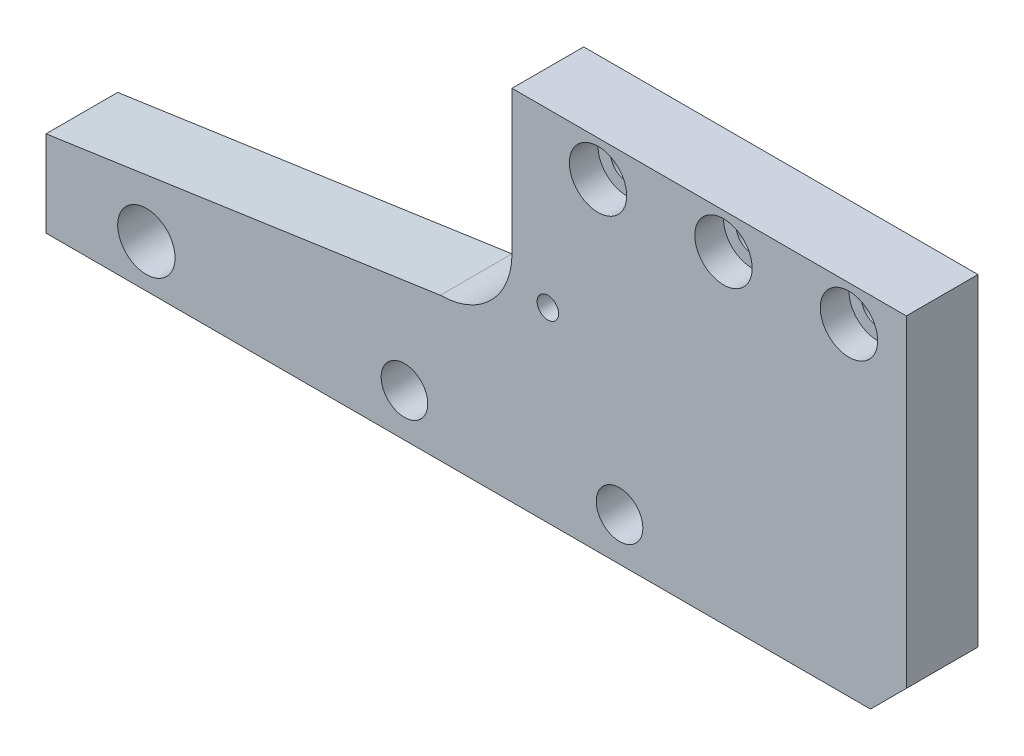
ISO-10303-21;
HEADER;
FILE_DESCRIPTION(('STEP AP214'),'2;1');
FILE_NAME('part.step','',(''),(''),'','','');
FILE_SCHEMA(('AUTOMOTIVE_DESIGN { 1 0 10303 214 1 1 1 1 }'));
ENDSEC;
DATA;
#1=APPLICATION_CONTEXT('core data for automotive mechanical design processes');
#2=APPLICATION_PROTOCOL_DEFINITION('international standard','automotive_design',2000,#1);
#3=PRODUCT_CONTEXT('',#1,'mechanical');
#4=PRODUCT('Part','Part','',(#3));
#5=PRODUCT_RELATED_PRODUCT_CATEGORY('part','',(#4));
#6=PRODUCT_DEFINITION_FORMATION('','',#4);
#7=PRODUCT_DEFINITION_CONTEXT('part definition',#1,'design');
#8=PRODUCT_DEFINITION('design','',#6,#7);
#9=PRODUCT_DEFINITION_SHAPE('','',#8);
#10=(LENGTH_UNIT() NAMED_UNIT(*) SI_UNIT(.MILLI.,.METRE.));
#11=(NAMED_UNIT(*) PLANE_ANGLE_UNIT() SI_UNIT($,.RADIAN.));
#12=(NAMED_UNIT(*) SI_UNIT($,.STERADIAN.) SOLID_ANGLE_UNIT());
#13=UNCERTAINTY_MEASURE_WITH_UNIT(LENGTH_MEASURE(1.E-05),#10,'distance_accuracy_value','');
#14=(GEOMETRIC_REPRESENTATION_CONTEXT(3) GLOBAL_UNCERTAINTY_ASSIGNED_CONTEXT((#13)) GLOBAL_UNIT_ASSIGNED_CONTEXT((#10,
#11,#12)) REPRESENTATION_CONTEXT('',''));
#15=CARTESIAN_POINT('',(0.,0.,0.));
#16=DIRECTION('',(0.,0.,1.));
#17=DIRECTION('',(1.,0.,0.));
#18=AXIS2_PLACEMENT_3D('',#15,#16,#17);
#19=CARTESIAN_POINT('',(120.000000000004,0.,9.99999999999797));
#20=DIRECTION('',(0.,0.,1.));
#21=DIRECTION('',(1.00000000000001,0.,0.));
#22=AXIS2_PLACEMENT_3D('',#19,#20,#21);
#23=PLANE('',#22);
#24=DIRECTION('',(1.00000000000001,0.,0.));
#25=VECTOR('',#24,1.);
#26=CARTESIAN_POINT('',(120.000000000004,-20.0000000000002,9.99999999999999));
#27=LINE('',#26,#25);
#28=CARTESIAN_POINT('',(0.,-20.,9.99999999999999));
#29=VERTEX_POINT('',#28);
#30=CARTESIAN_POINT('',(115.000000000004,-20.0000000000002,9.99999999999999));
#31=VERTEX_POINT('',#30);
#32=EDGE_CURVE('E160',#29,#31,#27,.T.);
#33=ORIENTED_EDGE('',*,*,#32,.T.);
#34=DIRECTION('',(-0.707106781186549,-0.707106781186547,0.));
#35=VECTOR('',#34,1.);
#36=CARTESIAN_POINT('',(127.500000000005,-7.50000000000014,9.99999999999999));
#37=LINE('',#36,#35);
#38=CARTESIAN_POINT('',(120.000000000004,-14.9999999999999,9.99999999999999));
#39=VERTEX_POINT('',#38);
#40=EDGE_CURVE('E11',#31,#39,#37,.F.);
#41=ORIENTED_EDGE('',*,*,#40,.T.);
#42=DIRECTION('',(0.,1.00000000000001,0.));
#43=VECTOR('',#42,1.);
#44=CARTESIAN_POINT('',(120.000000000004,-20.0000000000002,9.99999999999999));
#45=LINE('',#44,#43);
#46=CARTESIAN_POINT('',(120.000000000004,30.0000000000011,9.99999999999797));
#47=VERTEX_POINT('',#46);
#48=EDGE_CURVE('E135',#39,#47,#45,.T.);
#49=ORIENTED_EDGE('',*,*,#48,.T.);
#50=DIRECTION('',(-1.00000000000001,0.,0.));
#51=VECTOR('',#50,1.);
#52=CARTESIAN_POINT('',(120.000000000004,30.0000000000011,9.99999999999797));
#53=LINE('',#52,#51);
#54=CARTESIAN_POINT('',(65.0000000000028,30.0000000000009,9.99999999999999));
#55=VERTEX_POINT('',#54);
#56=EDGE_CURVE('E153',#47,#55,#53,.T.);
#57=ORIENTED_EDGE('',*,*,#56,.T.);
#58=DIRECTION('',(0.,-1.00000000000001,0.));
#59=VECTOR('',#58,1.);
#60=CARTESIAN_POINT('',(65.0000000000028,0.,9.99999999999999));
#61=LINE('',#60,#59);
#62=CARTESIAN_POINT('',(65.0000000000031,10.0000000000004,9.99999999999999));
#63=VERTEX_POINT('',#62);
#64=EDGE_CURVE('E155',#55,#63,#61,.T.);
#65=ORIENTED_EDGE('',*,*,#64,.T.);
#66=CARTESIAN_POINT('',(55.0000000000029,10.0000000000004,9.99999999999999));
#67=DIRECTION('',(0.,0.,1.));
#68=DIRECTION('',(1.00000000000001,0.,0.));
#69=AXIS2_PLACEMENT_3D('',#66,#67,#68);
#70=CIRCLE('',#69,10.);
#71=CARTESIAN_POINT('',(55.0000000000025,0.,9.99999999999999));
#72=VERTEX_POINT('',#71);
#73=EDGE_CURVE('E103',#63,#72,#70,.F.);
#74=ORIENTED_EDGE('',*,*,#73,.T.);
#75=DIRECTION('',(0.989586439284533,0.143939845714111,0.));
#76=VECTOR('',#75,1.);
#77=CARTESIAN_POINT('',(118.653285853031,9.25865976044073,9.99999999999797));
#78=LINE('',#77,#76);
#79=CARTESIAN_POINT('',(1.77635683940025E-12,-8.00000000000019,9.99999999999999));
#80=VERTEX_POINT('',#79);
#81=EDGE_CURVE('E113',#80,#72,#78,.T.);
#82=ORIENTED_EDGE('',*,*,#81,.F.);
#83=DIRECTION('',(0.,-1.00000000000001,0.));
#84=VECTOR('',#83,1.);
#85=CARTESIAN_POINT('',(0.,-20.,9.99999999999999));
#86=LINE('',#85,#84);
#87=EDGE_CURVE('E158',#80,#29,#86,.T.);
#88=ORIENTED_EDGE('',*,*,#87,.T.);
#89=EDGE_LOOP('',(#33,#41,#49,#57,#65,#74,#82,#88));
#90=FACE_BOUND('',#89,.T.);
#91=CARTESIAN_POINT('',(77.0000000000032,25.0000000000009,9.99999999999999));
#92=DIRECTION('',(0.,0.,1.));
#93=DIRECTION('',(1.00000000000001,0.,0.));
#94=AXIS2_PLACEMENT_3D('',#91,#92,#93);
#95=CIRCLE('',#94,4.);
#96=CARTESIAN_POINT('',(81.0000000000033,25.0000000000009,9.99999999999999));
#97=VERTEX_POINT('',#96);
#98=EDGE_CURVE('E305',#97,#97,#95,.T.);
#99=ORIENTED_EDGE('',*,*,#98,.F.);
#100=EDGE_LOOP('',(#99));
#101=FACE_BOUND('',#100,.T.);
#102=CARTESIAN_POINT('',(112.000000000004,25.0000000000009,9.99999999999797));
#103=DIRECTION('',(0.,0.,1.));
#104=DIRECTION('',(1.00000000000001,0.,0.));
#105=AXIS2_PLACEMENT_3D('',#102,#103,#104);
#106=CIRCLE('',#105,4.);
#107=CARTESIAN_POINT('',(116.000000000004,25.0000000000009,9.99999999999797));
#108=VERTEX_POINT('',#107);
#109=EDGE_CURVE('E321',#108,#108,#106,.T.);
#110=ORIENTED_EDGE('',*,*,#109,.F.);
#111=EDGE_LOOP('',(#110));
#112=FACE_BOUND('',#111,.T.);
#113=CARTESIAN_POINT('',(94.5000000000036,25.0000000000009,9.99999999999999));
#114=DIRECTION('',(0.,0.,1.));
#115=DIRECTION('',(1.00000000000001,0.,0.));
#116=AXIS2_PLACEMENT_3D('',#113,#114,#115);
#117=CIRCLE('',#116,4.);
#118=CARTESIAN_POINT('',(98.5000000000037,25.0000000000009,9.99999999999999));
#119=VERTEX_POINT('',#118);
#120=EDGE_CURVE('E333',#119,#119,#117,.T.);
#121=ORIENTED_EDGE('',*,*,#120,.F.);
#122=EDGE_LOOP('',(#121));
#123=FACE_BOUND('',#122,.T.);
#124=CARTESIAN_POINT('',(14.0000000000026,-14.0000000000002,9.99999999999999));
#125=DIRECTION('',(0.,0.,1.));
#126=DIRECTION('',(1.00000000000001,0.,0.));
#127=AXIS2_PLACEMENT_3D('',#124,#125,#126);
#128=CIRCLE('',#127,4.);
#129=CARTESIAN_POINT('',(18.0000000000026,-14.0000000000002,9.99999999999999));
#130=VERTEX_POINT('',#129);
#131=EDGE_CURVE('E345',#130,#130,#128,.T.);
#132=ORIENTED_EDGE('',*,*,#131,.F.);
#133=EDGE_LOOP('',(#132));
#134=FACE_BOUND('',#133,.T.);
#135=CARTESIAN_POINT('',(80.0000000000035,-14.0000000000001,9.99999999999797));
#136=DIRECTION('',(0.,0.,1.));
#137=DIRECTION('',(1.00000000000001,0.,0.));
#138=AXIS2_PLACEMENT_3D('',#135,#136,#137);
#139=CIRCLE('',#138,3.25000000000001);
#140=CARTESIAN_POINT('',(83.2500000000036,-14.0000000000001,9.99999999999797));
#141=VERTEX_POINT('',#140);
#142=EDGE_CURVE('E139',#141,#141,#139,.T.);
#143=ORIENTED_EDGE('',*,*,#142,.F.);
#144=EDGE_LOOP('',(#143));
#145=FACE_BOUND('',#144,.T.);
#146=CARTESIAN_POINT('',(50.0000000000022,-14.,9.99999999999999));
#147=DIRECTION('',(0.,0.,1.));
#148=DIRECTION('',(1.00000000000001,0.,0.));
#149=AXIS2_PLACEMENT_3D('',#146,#147,#148);
#150=CIRCLE('',#149,3.25000000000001);
#151=CARTESIAN_POINT('',(53.2500000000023,-14.,9.99999999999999));
#152=VERTEX_POINT('',#151);
#153=EDGE_CURVE('E351',#152,#152,#150,.T.);
#154=ORIENTED_EDGE('',*,*,#153,.F.);
#155=EDGE_LOOP('',(#154));
#156=FACE_BOUND('',#155,.T.);
#157=CARTESIAN_POINT('',(70.0000000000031,6.00000000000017,9.99999999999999));
#158=DIRECTION('',(0.,0.,1.));
#159=DIRECTION('',(1.00000000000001,0.,0.));
#160=AXIS2_PLACEMENT_3D('',#157,#158,#159);
#161=CIRCLE('',#160,1.5);
#162=CARTESIAN_POINT('',(71.5000000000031,6.00000000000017,9.99999999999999));
#163=VERTEX_POINT('',#162);
#164=EDGE_CURVE('E339',#163,#163,#161,.T.);
#165=ORIENTED_EDGE('',*,*,#164,.F.);
#166=EDGE_LOOP('',(#165));
#167=FACE_BOUND('',#166,.T.);
#168=ADVANCED_FACE('F28',(#90,#101,#112,#123,#134,#145,#156,#167),#23,.T.);
#169=CARTESIAN_POINT('',(120.000000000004,0.,-2.04003480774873E-12));
#170=DIRECTION('',(0.,0.,1.));
#171=DIRECTION('',(1.00000000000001,0.,0.));
#172=AXIS2_PLACEMENT_3D('',#169,#170,#171);
#173=PLANE('',#172);
#174=CARTESIAN_POINT('',(77.0000000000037,25.0000000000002,0.));
#175=DIRECTION('',(0.,0.,1.));
#176=DIRECTION('',(1.00000000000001,0.,0.));
#177=AXIS2_PLACEMENT_3D('',#174,#175,#176);
#178=CIRCLE('',#177,2.25);
#179=CARTESIAN_POINT('',(79.2500000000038,25.0000000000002,0.));
#180=VERTEX_POINT('',#179);
#181=EDGE_CURVE('E298',#180,#180,#178,.T.);
#182=ORIENTED_EDGE('',*,*,#181,.T.);
#183=EDGE_LOOP('',(#182));
#184=FACE_BOUND('',#183,.T.);
#185=CARTESIAN_POINT('',(112.000000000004,25.0000000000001,-2.04003480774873E-12));
#186=DIRECTION('',(0.,0.,1.));
#187=DIRECTION('',(1.00000000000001,0.,0.));
#188=AXIS2_PLACEMENT_3D('',#185,#186,#187);
#189=CIRCLE('',#188,2.25);
#190=CARTESIAN_POINT('',(114.250000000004,25.0000000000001,-2.04003480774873E-12));
#191=VERTEX_POINT('',#190);
#192=EDGE_CURVE('E312',#191,#191,#189,.T.);
#193=ORIENTED_EDGE('',*,*,#192,.T.);
#194=EDGE_LOOP('',(#193));
#195=FACE_BOUND('',#194,.T.);
#196=CARTESIAN_POINT('',(94.500000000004,25.0000000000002,0.));
#197=DIRECTION('',(0.,0.,1.));
#198=DIRECTION('',(1.00000000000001,0.,0.));
#199=AXIS2_PLACEMENT_3D('',#196,#197,#198);
#200=CIRCLE('',#199,2.25);
#201=CARTESIAN_POINT('',(96.750000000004,25.0000000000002,0.));
#202=VERTEX_POINT('',#201);
#203=EDGE_CURVE('E324',#202,#202,#200,.T.);
#204=ORIENTED_EDGE('',*,*,#203,.T.);
#205=EDGE_LOOP('',(#204));
#206=FACE_BOUND('',#205,.T.);
#207=CARTESIAN_POINT('',(14.0000000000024,-14.0000000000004,0.));
#208=DIRECTION('',(0.,0.,1.));
#209=DIRECTION('',(1.00000000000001,0.,0.));
#210=AXIS2_PLACEMENT_3D('',#207,#208,#209);
#211=CIRCLE('',#210,4.);
#212=CARTESIAN_POINT('',(18.0000000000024,-14.0000000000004,0.));
#213=VERTEX_POINT('',#212);
#214=EDGE_CURVE('E342',#213,#213,#211,.T.);
#215=ORIENTED_EDGE('',*,*,#214,.T.);
#216=EDGE_LOOP('',(#215));
#217=FACE_BOUND('',#216,.T.);
#218=CARTESIAN_POINT('',(80.0000000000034,-14.0000000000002,-2.04003480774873E-12));
#219=DIRECTION('',(0.,0.,1.));
#220=DIRECTION('',(1.00000000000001,0.,0.));
#221=AXIS2_PLACEMENT_3D('',#218,#219,#220);
#222=CIRCLE('',#221,3.25000000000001);
#223=CARTESIAN_POINT('',(83.2500000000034,-14.0000000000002,-2.04003480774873E-12));
#224=VERTEX_POINT('',#223);
#225=EDGE_CURVE('E144',#224,#224,#222,.T.);
#226=ORIENTED_EDGE('',*,*,#225,.T.);
#227=EDGE_LOOP('',(#226));
#228=FACE_BOUND('',#227,.T.);
#229=DIRECTION('',(0.,1.00000000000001,0.));
#230=VECTOR('',#229,1.);
#231=CARTESIAN_POINT('',(120.000000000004,-20.0000000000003,0.));
#232=LINE('',#231,#230);
#233=CARTESIAN_POINT('',(120.000000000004,-15.0000000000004,0.));
#234=VERTEX_POINT('',#233);
#235=CARTESIAN_POINT('',(120.000000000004,30.0000000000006,-2.04003480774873E-12));
#236=VERTEX_POINT('',#235);
#237=EDGE_CURVE('E133',#234,#236,#232,.T.);
#238=ORIENTED_EDGE('',*,*,#237,.F.);
#239=DIRECTION('',(0.707106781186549,0.707106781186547,0.));
#240=VECTOR('',#239,1.);
#241=CARTESIAN_POINT('',(120.000000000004,-15.0000000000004,0.));
#242=LINE('',#241,#240);
#243=CARTESIAN_POINT('',(115.000000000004,-20.0000000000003,0.));
#244=VERTEX_POINT('',#243);
#245=EDGE_CURVE('E50',#234,#244,#242,.F.);
#246=ORIENTED_EDGE('',*,*,#245,.T.);
#247=DIRECTION('',(1.00000000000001,0.,0.));
#248=VECTOR('',#247,1.);
#249=CARTESIAN_POINT('',(120.000000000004,-20.0000000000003,0.));
#250=LINE('',#249,#248);
#251=CARTESIAN_POINT('',(0.,-20.,0.));
#252=VERTEX_POINT('',#251);
#253=EDGE_CURVE('E150',#252,#244,#250,.T.);
#254=ORIENTED_EDGE('',*,*,#253,.F.);
#255=DIRECTION('',(0.,-1.00000000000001,0.));
#256=VECTOR('',#255,1.);
#257=CARTESIAN_POINT('',(0.,-20.,0.));
#258=LINE('',#257,#256);
#259=CARTESIAN_POINT('',(1.77635683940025E-12,-8.00000000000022,0.));
#260=VERTEX_POINT('',#259);
#261=EDGE_CURVE('E110',#260,#252,#258,.T.);
#262=ORIENTED_EDGE('',*,*,#261,.F.);
#263=DIRECTION('',(0.989586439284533,0.143939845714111,0.));
#264=VECTOR('',#263,1.);
#265=CARTESIAN_POINT('',(118.653285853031,9.2586597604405,-2.04003480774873E-12));
#266=LINE('',#265,#264);
#267=CARTESIAN_POINT('',(55.0000000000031,0.,0.));
#268=VERTEX_POINT('',#267);
#269=EDGE_CURVE('E107',#260,#268,#266,.T.);
#270=ORIENTED_EDGE('',*,*,#269,.T.);
#271=CARTESIAN_POINT('',(55.0000000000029,10.0000000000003,0.));
#272=DIRECTION('',(0.,0.,1.));
#273=DIRECTION('',(1.00000000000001,0.,0.));
#274=AXIS2_PLACEMENT_3D('',#271,#272,#273);
#275=CIRCLE('',#274,10.);
#276=CARTESIAN_POINT('',(65.0000000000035,10.0000000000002,0.));
#277=VERTEX_POINT('',#276);
#278=EDGE_CURVE('E93',#268,#277,#275,.T.);
#279=ORIENTED_EDGE('',*,*,#278,.T.);
#280=DIRECTION('',(0.,-1.00000000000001,0.));
#281=VECTOR('',#280,1.);
#282=CARTESIAN_POINT('',(65.0000000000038,0.,0.));
#283=LINE('',#282,#281);
#284=CARTESIAN_POINT('',(65.0000000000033,30.0000000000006,0.));
#285=VERTEX_POINT('',#284);
#286=EDGE_CURVE('E141',#285,#277,#283,.T.);
#287=ORIENTED_EDGE('',*,*,#286,.F.);
#288=DIRECTION('',(-1.00000000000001,0.,0.));
#289=VECTOR('',#288,1.);
#290=CARTESIAN_POINT('',(120.000000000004,30.0000000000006,-2.04003480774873E-12));
#291=LINE('',#290,#289);
#292=EDGE_CURVE('E138',#236,#285,#291,.T.);
#293=ORIENTED_EDGE('',*,*,#292,.F.);
#294=EDGE_LOOP('',(#238,#246,#254,#262,#270,#279,#287,#293));
#295=FACE_BOUND('',#294,.T.);
#296=CARTESIAN_POINT('',(50.0000000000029,-14.0000000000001,-2.04003480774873E-12));
#297=DIRECTION('',(0.,0.,1.));
#298=DIRECTION('',(1.00000000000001,0.,0.));
#299=AXIS2_PLACEMENT_3D('',#296,#297,#298);
#300=CIRCLE('',#299,3.25000000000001);
#301=CARTESIAN_POINT('',(53.2500000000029,-14.0000000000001,-2.04003480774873E-12));
#302=VERTEX_POINT('',#301);
#303=EDGE_CURVE('E348',#302,#302,#300,.T.);
#304=ORIENTED_EDGE('',*,*,#303,.T.);
#305=EDGE_LOOP('',(#304));
#306=FACE_BOUND('',#305,.T.);
#307=CARTESIAN_POINT('',(70.0000000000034,6.00000000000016,0.));
#308=DIRECTION('',(0.,0.,1.));
#309=DIRECTION('',(1.00000000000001,0.,0.));
#310=AXIS2_PLACEMENT_3D('',#307,#308,#309);
#311=CIRCLE('',#310,1.5);
#312=CARTESIAN_POINT('',(71.5000000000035,6.00000000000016,0.));
#313=VERTEX_POINT('',#312);
#314=EDGE_CURVE('E336',#313,#313,#311,.T.);
#315=ORIENTED_EDGE('',*,*,#314,.T.);
#316=EDGE_LOOP('',(#315));
#317=FACE_BOUND('',#316,.T.);
#318=ADVANCED_FACE('F108',(#184,#195,#206,#217,#228,#295,#306,#317),#173,.F.);
#319=CARTESIAN_POINT('',(120.000000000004,-20.0000000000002,9.99999999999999));
#320=DIRECTION('',(-1.00000000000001,0.,0.));
#321=DIRECTION('',(0.,0.,1.));
#322=AXIS2_PLACEMENT_3D('',#319,#320,#321);
#323=PLANE('',#322);
#324=ORIENTED_EDGE('',*,*,#48,.F.);
#325=DIRECTION('',(0.,0.,-1.));
#326=VECTOR('',#325,1.);
#327=CARTESIAN_POINT('',(120.000000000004,-14.9999999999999,9.99999999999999));
#328=LINE('',#327,#326);
#329=EDGE_CURVE('E126',#39,#234,#328,.T.);
#330=ORIENTED_EDGE('',*,*,#329,.T.);
#331=ORIENTED_EDGE('',*,*,#237,.T.);
#332=DIRECTION('',(0.,0.,-1.));
#333=VECTOR('',#332,1.);
#334=CARTESIAN_POINT('',(120.000000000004,30.0000000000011,9.99999999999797));
#335=LINE('',#334,#333);
#336=EDGE_CURVE('E117',#47,#236,#335,.T.);
#337=ORIENTED_EDGE('',*,*,#336,.F.);
#338=EDGE_LOOP('',(#324,#330,#331,#337));
#339=FACE_BOUND('',#338,.T.);
#340=ADVANCED_FACE('F30',(#339),#323,.F.);
#341=CARTESIAN_POINT('',(120.000000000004,30.0000000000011,9.99999999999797));
#342=DIRECTION('',(0.,-1.00000000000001,0.));
#343=DIRECTION('',(1.00000000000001,0.,0.));
#344=AXIS2_PLACEMENT_3D('',#341,#342,#343);
#345=PLANE('',#344);
#346=ORIENTED_EDGE('',*,*,#292,.T.);
#347=DIRECTION('',(0.,0.,-1.));
#348=VECTOR('',#347,1.);
#349=CARTESIAN_POINT('',(65.0000000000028,30.0000000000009,9.99999999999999));
#350=LINE('',#349,#348);
#351=EDGE_CURVE('E121',#55,#285,#350,.T.);
#352=ORIENTED_EDGE('',*,*,#351,.F.);
#353=ORIENTED_EDGE('',*,*,#56,.F.);
#354=ORIENTED_EDGE('',*,*,#336,.T.);
#355=EDGE_LOOP('',(#346,#352,#353,#354));
#356=FACE_BOUND('',#355,.T.);
#357=ADVANCED_FACE('F171',(#356),#345,.F.);
#358=CARTESIAN_POINT('',(65.0000000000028,0.,9.99999999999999));
#359=DIRECTION('',(1.00000000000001,0.,0.));
#360=DIRECTION('',(0.,0.,-1.));
#361=AXIS2_PLACEMENT_3D('',#358,#359,#360);
#362=PLANE('',#361);
#363=ORIENTED_EDGE('',*,*,#286,.T.);
#364=DIRECTION('',(0.,0.,-1.));
#365=VECTOR('',#364,1.);
#366=CARTESIAN_POINT('',(65.0000000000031,10.0000000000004,9.99999999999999));
#367=LINE('',#366,#365);
#368=EDGE_CURVE('E100',#277,#63,#367,.F.);
#369=ORIENTED_EDGE('',*,*,#368,.T.);
#370=ORIENTED_EDGE('',*,*,#64,.F.);
#371=ORIENTED_EDGE('',*,*,#351,.T.);
#372=EDGE_LOOP('',(#363,#369,#370,#371));
#373=FACE_BOUND('',#372,.T.);
#374=ADVANCED_FACE('F168',(#373),#362,.F.);
#375=CARTESIAN_POINT('',(0.,-20.,9.99999999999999));
#376=DIRECTION('',(1.00000000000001,0.,0.));
#377=DIRECTION('',(0.,0.,-1.));
#378=AXIS2_PLACEMENT_3D('',#375,#376,#377);
#379=PLANE('',#378);
#380=ORIENTED_EDGE('',*,*,#87,.F.);
#381=DIRECTION('',(0.,0.,-1.));
#382=VECTOR('',#381,1.);
#383=CARTESIAN_POINT('',(2.26207941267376E-12,-8.00000000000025,172.980060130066));
#384=LINE('',#383,#382);
#385=EDGE_CURVE('E114',#80,#260,#384,.T.);
#386=ORIENTED_EDGE('',*,*,#385,.T.);
#387=ORIENTED_EDGE('',*,*,#261,.T.);
#388=DIRECTION('',(0.,0.,-1.));
#389=VECTOR('',#388,1.);
#390=CARTESIAN_POINT('',(0.,-20.,9.99999999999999));
#391=LINE('',#390,#389);
#392=EDGE_CURVE('E162',#29,#252,#391,.T.);
#393=ORIENTED_EDGE('',*,*,#392,.F.);
#394=EDGE_LOOP('',(#380,#386,#387,#393));
#395=FACE_BOUND('',#394,.T.);
#396=ADVANCED_FACE('F194',(#395),#379,.F.);
#397=CARTESIAN_POINT('',(120.000000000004,-20.0000000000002,9.99999999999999));
#398=DIRECTION('',(0.,1.00000000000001,0.));
#399=DIRECTION('',(-1.00000000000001,0.,0.));
#400=AXIS2_PLACEMENT_3D('',#397,#398,#399);
#401=PLANE('',#400);
#402=ORIENTED_EDGE('',*,*,#253,.T.);
#403=DIRECTION('',(0.,0.,1.));
#404=VECTOR('',#403,1.);
#405=CARTESIAN_POINT('',(115.000000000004,-20.0000000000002,9.99999999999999));
#406=LINE('',#405,#404);
#407=EDGE_CURVE('E36',#244,#31,#406,.T.);
#408=ORIENTED_EDGE('',*,*,#407,.T.);
#409=ORIENTED_EDGE('',*,*,#32,.F.);
#410=ORIENTED_EDGE('',*,*,#392,.T.);
#411=EDGE_LOOP('',(#402,#408,#409,#410));
#412=FACE_BOUND('',#411,.T.);
#413=ADVANCED_FACE('F190',(#412),#401,.F.);
#414=CARTESIAN_POINT('',(80.0000000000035,-14.0000000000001,9.99999999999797));
#415=DIRECTION('',(0.,0.,-1.));
#416=DIRECTION('',(-1.00000000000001,0.,0.));
#417=AXIS2_PLACEMENT_3D('',#414,#415,#416);
#418=CYLINDRICAL_SURFACE('',#417,3.25000000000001);
#419=ORIENTED_EDGE('',*,*,#142,.T.);
#420=EDGE_LOOP('',(#419));
#421=FACE_BOUND('',#420,.T.);
#422=ORIENTED_EDGE('',*,*,#225,.F.);
#423=EDGE_LOOP('',(#422));
#424=FACE_BOUND('',#423,.T.);
#425=ADVANCED_FACE('F193',(#421,#424),#418,.F.);
#426=CARTESIAN_POINT('',(50.0000000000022,-14.,9.99999999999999));
#427=DIRECTION('',(0.,0.,-1.));
#428=DIRECTION('',(-1.00000000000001,0.,0.));
#429=AXIS2_PLACEMENT_3D('',#426,#427,#428);
#430=CYLINDRICAL_SURFACE('',#429,3.25000000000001);
#431=ORIENTED_EDGE('',*,*,#153,.T.);
#432=EDGE_LOOP('',(#431));
#433=FACE_BOUND('',#432,.T.);
#434=ORIENTED_EDGE('',*,*,#303,.F.);
#435=EDGE_LOOP('',(#434));
#436=FACE_BOUND('',#435,.T.);
#437=ADVANCED_FACE('F217',(#433,#436),#430,.F.);
#438=CARTESIAN_POINT('',(14.0000000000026,-14.0000000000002,9.99999999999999));
#439=DIRECTION('',(0.,0.,-1.));
#440=DIRECTION('',(-1.00000000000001,0.,0.));
#441=AXIS2_PLACEMENT_3D('',#438,#439,#440);
#442=CYLINDRICAL_SURFACE('',#441,4.);
#443=ORIENTED_EDGE('',*,*,#131,.T.);
#444=EDGE_LOOP('',(#443));
#445=FACE_BOUND('',#444,.T.);
#446=ORIENTED_EDGE('',*,*,#214,.F.);
#447=EDGE_LOOP('',(#446));
#448=FACE_BOUND('',#447,.T.);
#449=ADVANCED_FACE('F222',(#445,#448),#442,.F.);
#450=CARTESIAN_POINT('',(70.0000000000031,6.00000000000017,9.99999999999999));
#451=DIRECTION('',(0.,0.,-1.));
#452=DIRECTION('',(-1.00000000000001,0.,0.));
#453=AXIS2_PLACEMENT_3D('',#450,#451,#452);
#454=CYLINDRICAL_SURFACE('',#453,1.5);
#455=ORIENTED_EDGE('',*,*,#164,.T.);
#456=EDGE_LOOP('',(#455));
#457=FACE_BOUND('',#456,.T.);
#458=ORIENTED_EDGE('',*,*,#314,.F.);
#459=EDGE_LOOP('',(#458));
#460=FACE_BOUND('',#459,.T.);
#461=ADVANCED_FACE('F228',(#457,#460),#454,.F.);
#462=CARTESIAN_POINT('',(94.5000000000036,25.0000000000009,9.99999999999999));
#463=DIRECTION('',(0.,0.,1.));
#464=DIRECTION('',(1.00000000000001,0.,0.));
#465=AXIS2_PLACEMENT_3D('',#462,#463,#464);
#466=CYLINDRICAL_SURFACE('',#465,4.);
#467=CARTESIAN_POINT('',(94.5000000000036,25.0000000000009,5.99999999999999));
#468=DIRECTION('',(0.,0.,1.));
#469=DIRECTION('',(1.00000000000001,0.,0.));
#470=AXIS2_PLACEMENT_3D('',#467,#468,#469);
#471=CIRCLE('',#470,4.);
#472=CARTESIAN_POINT('',(98.5000000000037,25.0000000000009,5.99999999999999));
#473=VERTEX_POINT('',#472);
#474=EDGE_CURVE('E330',#473,#473,#471,.T.);
#475=ORIENTED_EDGE('',*,*,#474,.F.);
#476=EDGE_LOOP('',(#475));
#477=FACE_BOUND('',#476,.T.);
#478=ORIENTED_EDGE('',*,*,#120,.T.);
#479=EDGE_LOOP('',(#478));
#480=FACE_BOUND('',#479,.T.);
#481=ADVANCED_FACE('F234',(#477,#480),#466,.F.);
#482=CARTESIAN_POINT('',(96.7500000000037,25.0000000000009,5.99999999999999));
#483=DIRECTION('',(0.,0.,-1.));
#484=DIRECTION('',(-1.00000000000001,0.,0.));
#485=AXIS2_PLACEMENT_3D('',#482,#483,#484);
#486=PLANE('',#485);
#487=CARTESIAN_POINT('',(94.5000000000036,25.0000000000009,5.99999999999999));
#488=DIRECTION('',(0.,0.,1.));
#489=DIRECTION('',(1.00000000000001,0.,0.));
#490=AXIS2_PLACEMENT_3D('',#487,#488,#489);
#491=CIRCLE('',#490,2.25);
#492=CARTESIAN_POINT('',(96.7500000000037,25.0000000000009,5.99999999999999));
#493=VERTEX_POINT('',#492);
#494=EDGE_CURVE('E327',#493,#493,#491,.T.);
#495=ORIENTED_EDGE('',*,*,#494,.F.);
#496=EDGE_LOOP('',(#495));
#497=FACE_BOUND('',#496,.T.);
#498=ORIENTED_EDGE('',*,*,#474,.T.);
#499=EDGE_LOOP('',(#498));
#500=FACE_BOUND('',#499,.T.);
#501=ADVANCED_FACE('F240',(#497,#500),#486,.F.);
#502=CARTESIAN_POINT('',(94.5000000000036,25.0000000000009,9.99999999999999));
#503=DIRECTION('',(0.,0.,1.));
#504=DIRECTION('',(1.00000000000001,0.,0.));
#505=AXIS2_PLACEMENT_3D('',#502,#503,#504);
#506=CYLINDRICAL_SURFACE('',#505,2.25);
#507=ORIENTED_EDGE('',*,*,#203,.F.);
#508=EDGE_LOOP('',(#507));
#509=FACE_BOUND('',#508,.T.);
#510=ORIENTED_EDGE('',*,*,#494,.T.);
#511=EDGE_LOOP('',(#510));
#512=FACE_BOUND('',#511,.T.);
#513=ADVANCED_FACE('F246',(#509,#512),#506,.F.);
#514=CARTESIAN_POINT('',(112.000000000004,25.0000000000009,9.99999999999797));
#515=DIRECTION('',(0.,0.,1.));
#516=DIRECTION('',(1.00000000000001,0.,0.));
#517=AXIS2_PLACEMENT_3D('',#514,#515,#516);
#518=CYLINDRICAL_SURFACE('',#517,4.);
#519=CARTESIAN_POINT('',(112.000000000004,25.0000000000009,5.99999999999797));
#520=DIRECTION('',(0.,0.,1.));
#521=DIRECTION('',(1.00000000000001,0.,0.));
#522=AXIS2_PLACEMENT_3D('',#519,#520,#521);
#523=CIRCLE('',#522,4.);
#524=CARTESIAN_POINT('',(116.000000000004,25.0000000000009,5.99999999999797));
#525=VERTEX_POINT('',#524);
#526=EDGE_CURVE('E318',#525,#525,#523,.T.);
#527=ORIENTED_EDGE('',*,*,#526,.F.);
#528=EDGE_LOOP('',(#527));
#529=FACE_BOUND('',#528,.T.);
#530=ORIENTED_EDGE('',*,*,#109,.T.);
#531=EDGE_LOOP('',(#530));
#532=FACE_BOUND('',#531,.T.);
#533=ADVANCED_FACE('F252',(#529,#532),#518,.F.);
#534=CARTESIAN_POINT('',(114.250000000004,25.0000000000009,5.99999999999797));
#535=DIRECTION('',(0.,0.,-1.));
#536=DIRECTION('',(-1.00000000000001,0.,0.));
#537=AXIS2_PLACEMENT_3D('',#534,#535,#536);
#538=PLANE('',#537);
#539=CARTESIAN_POINT('',(112.000000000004,25.0000000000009,5.99999999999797));
#540=DIRECTION('',(0.,0.,1.));
#541=DIRECTION('',(1.00000000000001,0.,0.));
#542=AXIS2_PLACEMENT_3D('',#539,#540,#541);
#543=CIRCLE('',#542,2.25);
#544=CARTESIAN_POINT('',(114.250000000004,25.0000000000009,5.99999999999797));
#545=VERTEX_POINT('',#544);
#546=EDGE_CURVE('E315',#545,#545,#543,.T.);
#547=ORIENTED_EDGE('',*,*,#546,.F.);
#548=EDGE_LOOP('',(#547));
#549=FACE_BOUND('',#548,.T.);
#550=ORIENTED_EDGE('',*,*,#526,.T.);
#551=EDGE_LOOP('',(#550));
#552=FACE_BOUND('',#551,.T.);
#553=ADVANCED_FACE('F258',(#549,#552),#538,.F.);
#554=CARTESIAN_POINT('',(112.000000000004,25.0000000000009,9.99999999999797));
#555=DIRECTION('',(0.,0.,1.));
#556=DIRECTION('',(1.00000000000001,0.,0.));
#557=AXIS2_PLACEMENT_3D('',#554,#555,#556);
#558=CYLINDRICAL_SURFACE('',#557,2.25);
#559=ORIENTED_EDGE('',*,*,#192,.F.);
#560=EDGE_LOOP('',(#559));
#561=FACE_BOUND('',#560,.T.);
#562=ORIENTED_EDGE('',*,*,#546,.T.);
#563=EDGE_LOOP('',(#562));
#564=FACE_BOUND('',#563,.T.);
#565=ADVANCED_FACE('F264',(#561,#564),#558,.F.);
#566=CARTESIAN_POINT('',(77.0000000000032,25.0000000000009,9.99999999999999));
#567=DIRECTION('',(0.,0.,1.));
#568=DIRECTION('',(1.00000000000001,0.,0.));
#569=AXIS2_PLACEMENT_3D('',#566,#567,#568);
#570=CYLINDRICAL_SURFACE('',#569,4.);
#571=CARTESIAN_POINT('',(77.0000000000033,25.0000000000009,5.99999999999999));
#572=DIRECTION('',(0.,0.,1.));
#573=DIRECTION('',(1.00000000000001,0.,0.));
#574=AXIS2_PLACEMENT_3D('',#571,#572,#573);
#575=CIRCLE('',#574,4.);
#576=CARTESIAN_POINT('',(81.0000000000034,25.0000000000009,5.99999999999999));
#577=VERTEX_POINT('',#576);
#578=EDGE_CURVE('E302',#577,#577,#575,.T.);
#579=ORIENTED_EDGE('',*,*,#578,.F.);
#580=EDGE_LOOP('',(#579));
#581=FACE_BOUND('',#580,.T.);
#582=ORIENTED_EDGE('',*,*,#98,.T.);
#583=EDGE_LOOP('',(#582));
#584=FACE_BOUND('',#583,.T.);
#585=ADVANCED_FACE('F270',(#581,#584),#570,.F.);
#586=CARTESIAN_POINT('',(79.2500000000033,25.0000000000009,5.99999999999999));
#587=DIRECTION('',(0.,0.,-1.));
#588=DIRECTION('',(-1.00000000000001,0.,0.));
#589=AXIS2_PLACEMENT_3D('',#586,#587,#588);
#590=PLANE('',#589);
#591=CARTESIAN_POINT('',(77.0000000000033,25.0000000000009,5.99999999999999));
#592=DIRECTION('',(0.,0.,1.));
#593=DIRECTION('',(1.00000000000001,0.,0.));
#594=AXIS2_PLACEMENT_3D('',#591,#592,#593);
#595=CIRCLE('',#594,2.25);
#596=CARTESIAN_POINT('',(79.2500000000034,25.0000000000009,5.99999999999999));
#597=VERTEX_POINT('',#596);
#598=EDGE_CURVE('E301',#597,#597,#595,.T.);
#599=ORIENTED_EDGE('',*,*,#598,.F.);
#600=EDGE_LOOP('',(#599));
#601=FACE_BOUND('',#600,.T.);
#602=ORIENTED_EDGE('',*,*,#578,.T.);
#603=EDGE_LOOP('',(#602));
#604=FACE_BOUND('',#603,.T.);
#605=ADVANCED_FACE('F276',(#601,#604),#590,.F.);
#606=CARTESIAN_POINT('',(77.0000000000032,25.0000000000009,9.99999999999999));
#607=DIRECTION('',(0.,0.,1.));
#608=DIRECTION('',(1.00000000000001,0.,0.));
#609=AXIS2_PLACEMENT_3D('',#606,#607,#608);
#610=CYLINDRICAL_SURFACE('',#609,2.25);
#611=ORIENTED_EDGE('',*,*,#181,.F.);
#612=EDGE_LOOP('',(#611));
#613=FACE_BOUND('',#612,.T.);
#614=ORIENTED_EDGE('',*,*,#598,.T.);
#615=EDGE_LOOP('',(#614));
#616=FACE_BOUND('',#615,.T.);
#617=ADVANCED_FACE('F282',(#613,#616),#610,.F.);
#618=CARTESIAN_POINT('',(55.0000000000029,10.0000000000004,9.99999999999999));
#619=DIRECTION('',(0.,0.,1.));
#620=DIRECTION('',(1.00000000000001,0.,0.));
#621=AXIS2_PLACEMENT_3D('',#618,#619,#620);
#622=CYLINDRICAL_SURFACE('',#621,10.);
#623=ORIENTED_EDGE('',*,*,#73,.F.);
#624=ORIENTED_EDGE('',*,*,#368,.F.);
#625=ORIENTED_EDGE('',*,*,#278,.F.);
#626=DIRECTION('',(0.,0.,-1.));
#627=VECTOR('',#626,1.);
#628=CARTESIAN_POINT('',(55.0000000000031,0.,0.));
#629=LINE('',#628,#627);
#630=EDGE_CURVE('E98',#72,#268,#629,.T.);
#631=ORIENTED_EDGE('',*,*,#630,.F.);
#632=EDGE_LOOP('',(#623,#624,#625,#631));
#633=FACE_BOUND('',#632,.T.);
#634=ADVANCED_FACE('F96',(#633),#622,.F.);
#635=CARTESIAN_POINT('',(55.0000000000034,0.,172.980060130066));
#636=DIRECTION('',(0.143939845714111,-0.989586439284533,0.));
#637=DIRECTION('',(0.989586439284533,0.143939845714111,0.));
#638=AXIS2_PLACEMENT_3D('',#635,#636,#637);
#639=PLANE('',#638);
#640=ORIENTED_EDGE('',*,*,#385,.F.);
#641=ORIENTED_EDGE('',*,*,#81,.T.);
#642=ORIENTED_EDGE('',*,*,#630,.T.);
#643=ORIENTED_EDGE('',*,*,#269,.F.);
#644=EDGE_LOOP('',(#640,#641,#642,#643));
#645=FACE_BOUND('',#644,.T.);
#646=ADVANCED_FACE('F116',(#645),#639,.F.);
#647=CARTESIAN_POINT('',(120.000000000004,-14.9999999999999,9.99999999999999));
#648=DIRECTION('',(-0.707106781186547,0.707106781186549,0.));
#649=DIRECTION('',(-0.707106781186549,-0.707106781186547,0.));
#650=AXIS2_PLACEMENT_3D('',#647,#648,#649);
#651=PLANE('',#650);
#652=ORIENTED_EDGE('',*,*,#40,.F.);
#653=ORIENTED_EDGE('',*,*,#407,.F.);
#654=ORIENTED_EDGE('',*,*,#245,.F.);
#655=ORIENTED_EDGE('',*,*,#329,.F.);
#656=EDGE_LOOP('',(#652,#653,#654,#655));
#657=FACE_BOUND('',#656,.T.);
#658=ADVANCED_FACE('F174',(#657),#651,.F.);
#659=CLOSED_SHELL('',(#168,#318,#340,#357,#374,#396,#413,#425,#437,#449,#461,#481,#501,#513,
#533,#553,#565,#585,#605,#617,#634,#646,#658));
#660=MANIFOLD_SOLID_BREP('B2',#659);
#661=ADVANCED_BREP_SHAPE_REPRESENTATION('',(#18,#660),#14);
#662=SHAPE_DEFINITION_REPRESENTATION(#9,#661);
ENDSEC;
END-ISO-10303-21;
